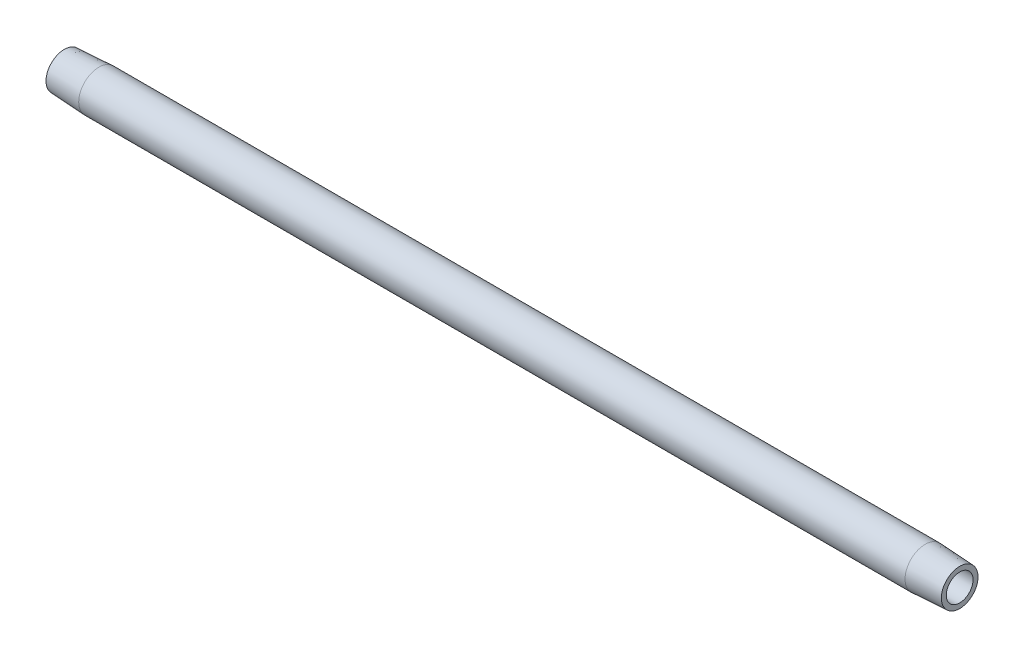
from build123d import *


with BuildPart() as part:
    # Sketch2 → Revolve1 (revolve)
    with BuildSketch(Plane.XY, mode=Mode.PRIVATE) as revolve1_sk:
        Polygon((8.810039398, 5.1435), (0, 4.6817854), (0, 3.4163), (228.6, 3.4163), (228.6, 4.6817854), (219.789960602, 5.1435), align=None)
    revolve(revolve1_sk.sketch.rotate(Axis((0.476141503, 0, 0), (1, 0, 0)), 90), axis=Axis((0.476141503, 0, 0), (1, 0, 0)))


solid = part.part
